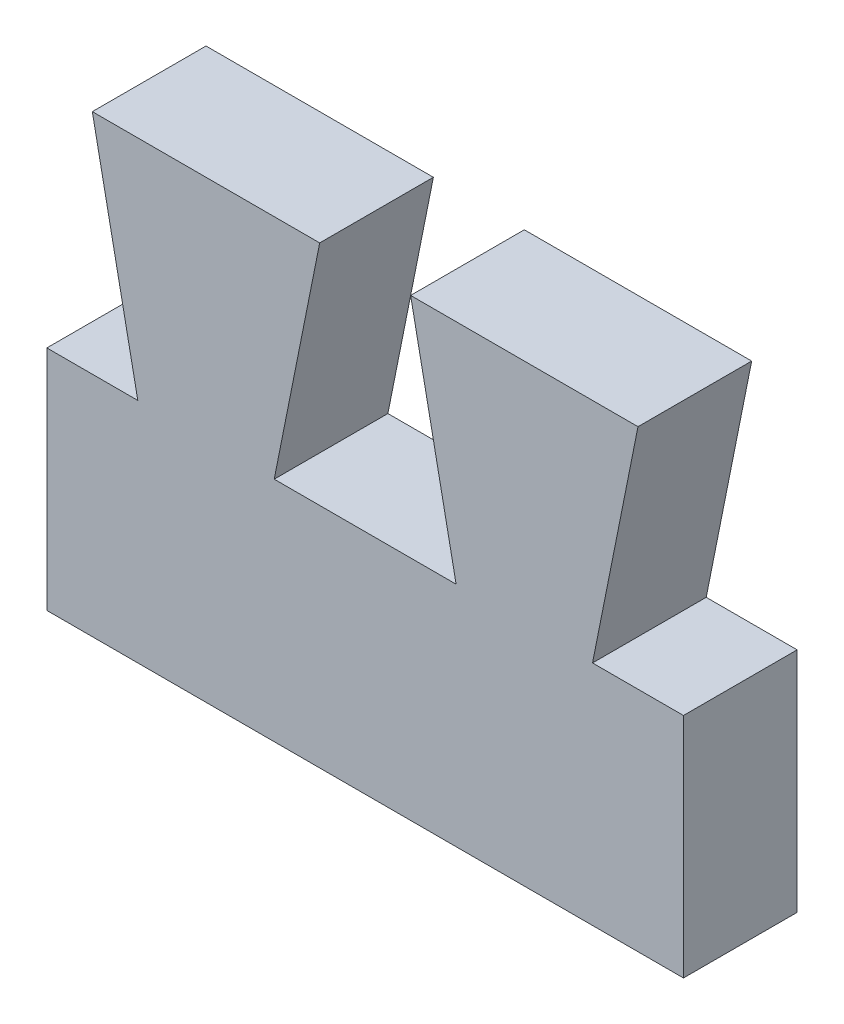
ISO-10303-21;
HEADER;
FILE_DESCRIPTION(('STEP AP214'),'2;1');
FILE_NAME('part.step','',(''),(''),'','','');
FILE_SCHEMA(('AUTOMOTIVE_DESIGN { 1 0 10303 214 1 1 1 1 }'));
ENDSEC;
DATA;
#1=APPLICATION_CONTEXT('core data for automotive mechanical design processes');
#2=APPLICATION_PROTOCOL_DEFINITION('international standard','automotive_design',2000,#1);
#3=PRODUCT_CONTEXT('',#1,'mechanical');
#4=PRODUCT('Part','Part','',(#3));
#5=PRODUCT_RELATED_PRODUCT_CATEGORY('part','',(#4));
#6=PRODUCT_DEFINITION_FORMATION('','',#4);
#7=PRODUCT_DEFINITION_CONTEXT('part definition',#1,'design');
#8=PRODUCT_DEFINITION('design','',#6,#7);
#9=PRODUCT_DEFINITION_SHAPE('','',#8);
#10=(LENGTH_UNIT() NAMED_UNIT(*) SI_UNIT(.MILLI.,.METRE.));
#11=(NAMED_UNIT(*) PLANE_ANGLE_UNIT() SI_UNIT($,.RADIAN.));
#12=(NAMED_UNIT(*) SI_UNIT($,.STERADIAN.) SOLID_ANGLE_UNIT());
#13=UNCERTAINTY_MEASURE_WITH_UNIT(LENGTH_MEASURE(1.E-05),#10,'distance_accuracy_value','');
#14=(GEOMETRIC_REPRESENTATION_CONTEXT(3) GLOBAL_UNCERTAINTY_ASSIGNED_CONTEXT((#13)) GLOBAL_UNIT_ASSIGNED_CONTEXT((#10,
#11,#12)) REPRESENTATION_CONTEXT('',''));
#15=CARTESIAN_POINT('',(0.,0.,0.));
#16=DIRECTION('',(0.,0.,1.));
#17=DIRECTION('',(1.,0.,0.));
#18=AXIS2_PLACEMENT_3D('',#15,#16,#17);
#19=CARTESIAN_POINT('',(14.,-5.,0.));
#20=DIRECTION('',(0.,1.,0.));
#21=DIRECTION('',(-1.,0.,0.));
#22=AXIS2_PLACEMENT_3D('',#19,#20,#21);
#23=PLANE('',#22);
#24=DIRECTION('',(0.,0.,-1.));
#25=VECTOR('',#24,1.);
#26=CARTESIAN_POINT('',(10.,-5.,5.));
#27=LINE('',#26,#25);
#28=CARTESIAN_POINT('',(10.,-5.,5.));
#29=VERTEX_POINT('',#28);
#30=CARTESIAN_POINT('',(10.,-5.,0.));
#31=VERTEX_POINT('',#30);
#32=EDGE_CURVE('E159',#29,#31,#27,.T.);
#33=ORIENTED_EDGE('',*,*,#32,.F.);
#34=DIRECTION('',(-1.,0.,0.));
#35=VECTOR('',#34,1.);
#36=CARTESIAN_POINT('',(14.,-5.,5.));
#37=LINE('',#36,#35);
#38=CARTESIAN_POINT('',(14.,-5.,5.));
#39=VERTEX_POINT('',#38);
#40=EDGE_CURVE('E151',#39,#29,#37,.T.);
#41=ORIENTED_EDGE('',*,*,#40,.F.);
#42=DIRECTION('',(0.,0.,1.));
#43=VECTOR('',#42,1.);
#44=CARTESIAN_POINT('',(14.,-5.,0.));
#45=LINE('',#44,#43);
#46=CARTESIAN_POINT('',(14.,-5.,0.));
#47=VERTEX_POINT('',#46);
#48=EDGE_CURVE('E192',#47,#39,#45,.T.);
#49=ORIENTED_EDGE('',*,*,#48,.F.);
#50=DIRECTION('',(-1.,0.,0.));
#51=VECTOR('',#50,1.);
#52=CARTESIAN_POINT('',(14.,-5.,0.));
#53=LINE('',#52,#51);
#54=EDGE_CURVE('E51',#47,#31,#53,.T.);
#55=ORIENTED_EDGE('',*,*,#54,.T.);
#56=EDGE_LOOP('',(#33,#41,#49,#55));
#57=FACE_BOUND('',#56,.T.);
#58=ADVANCED_FACE('F36',(#57),#23,.T.);
#59=CARTESIAN_POINT('',(-2.88461538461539,0.576923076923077,5.));
#60=DIRECTION('',(-0.98058067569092,0.196116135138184,0.));
#61=DIRECTION('',(-0.196116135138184,-0.98058067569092,0.));
#62=AXIS2_PLACEMENT_3D('',#59,#60,#61);
#63=PLANE('',#62);
#64=DIRECTION('',(0.196116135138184,0.98058067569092,0.));
#65=VECTOR('',#64,1.);
#66=CARTESIAN_POINT('',(-2.88461538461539,0.576923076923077,0.));
#67=LINE('',#66,#65);
#68=CARTESIAN_POINT('',(-4.,-5.,0.));
#69=VERTEX_POINT('',#68);
#70=CARTESIAN_POINT('',(-2.,5.,0.));
#71=VERTEX_POINT('',#70);
#72=EDGE_CURVE('E191',#69,#71,#67,.T.);
#73=ORIENTED_EDGE('',*,*,#72,.T.);
#74=DIRECTION('',(0.,0.,-1.));
#75=VECTOR('',#74,1.);
#76=CARTESIAN_POINT('',(-2.,5.,5.));
#77=LINE('',#76,#75);
#78=CARTESIAN_POINT('',(-2.,5.,5.));
#79=VERTEX_POINT('',#78);
#80=EDGE_CURVE('E44',#79,#71,#77,.T.);
#81=ORIENTED_EDGE('',*,*,#80,.F.);
#82=DIRECTION('',(0.196116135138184,0.98058067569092,0.));
#83=VECTOR('',#82,1.);
#84=CARTESIAN_POINT('',(-2.88461538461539,0.576923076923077,5.));
#85=LINE('',#84,#83);
#86=CARTESIAN_POINT('',(-4.,-5.,5.));
#87=VERTEX_POINT('',#86);
#88=EDGE_CURVE('E197',#87,#79,#85,.T.);
#89=ORIENTED_EDGE('',*,*,#88,.F.);
#90=DIRECTION('',(0.,0.,-1.));
#91=VECTOR('',#90,1.);
#92=CARTESIAN_POINT('',(-4.,-5.,5.));
#93=LINE('',#92,#91);
#94=EDGE_CURVE('E11',#87,#69,#93,.T.);
#95=ORIENTED_EDGE('',*,*,#94,.T.);
#96=EDGE_LOOP('',(#73,#81,#89,#95));
#97=FACE_BOUND('',#96,.T.);
#98=ADVANCED_FACE('F38',(#97),#63,.F.);
#99=CARTESIAN_POINT('',(0.,5.,5.));
#100=DIRECTION('',(0.,-1.,0.));
#101=DIRECTION('',(1.,0.,0.));
#102=AXIS2_PLACEMENT_3D('',#99,#100,#101);
#103=PLANE('',#102);
#104=DIRECTION('',(-1.,0.,0.));
#105=VECTOR('',#104,1.);
#106=CARTESIAN_POINT('',(0.,5.,0.));
#107=LINE('',#106,#105);
#108=CARTESIAN_POINT('',(-12.,5.,0.));
#109=VERTEX_POINT('',#108);
#110=EDGE_CURVE('E206',#71,#109,#107,.T.);
#111=ORIENTED_EDGE('',*,*,#110,.T.);
#112=DIRECTION('',(0.,0.,-1.));
#113=VECTOR('',#112,1.);
#114=CARTESIAN_POINT('',(-12.,5.,5.));
#115=LINE('',#114,#113);
#116=CARTESIAN_POINT('',(-12.,5.,5.));
#117=VERTEX_POINT('',#116);
#118=EDGE_CURVE('E211',#117,#109,#115,.T.);
#119=ORIENTED_EDGE('',*,*,#118,.F.);
#120=DIRECTION('',(-1.,0.,0.));
#121=VECTOR('',#120,1.);
#122=CARTESIAN_POINT('',(0.,5.,5.));
#123=LINE('',#122,#121);
#124=EDGE_CURVE('E199',#79,#117,#123,.T.);
#125=ORIENTED_EDGE('',*,*,#124,.F.);
#126=ORIENTED_EDGE('',*,*,#80,.T.);
#127=EDGE_LOOP('',(#111,#119,#125,#126));
#128=FACE_BOUND('',#127,.T.);
#129=ADVANCED_FACE('F218',(#128),#103,.F.);
#130=CARTESIAN_POINT('',(-10.5769230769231,-2.11538461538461,5.));
#131=DIRECTION('',(0.98058067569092,0.196116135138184,0.));
#132=DIRECTION('',(-0.196116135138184,0.98058067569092,0.));
#133=AXIS2_PLACEMENT_3D('',#130,#131,#132);
#134=PLANE('',#133);
#135=DIRECTION('',(0.196116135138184,-0.98058067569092,0.));
#136=VECTOR('',#135,1.);
#137=CARTESIAN_POINT('',(-10.5769230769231,-2.11538461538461,0.));
#138=LINE('',#137,#136);
#139=CARTESIAN_POINT('',(-10.,-5.,0.));
#140=VERTEX_POINT('',#139);
#141=EDGE_CURVE('E200',#109,#140,#138,.T.);
#142=ORIENTED_EDGE('',*,*,#141,.T.);
#143=DIRECTION('',(0.,0.,-1.));
#144=VECTOR('',#143,1.);
#145=CARTESIAN_POINT('',(-10.,-5.,5.));
#146=LINE('',#145,#144);
#147=CARTESIAN_POINT('',(-10.,-5.,5.));
#148=VERTEX_POINT('',#147);
#149=EDGE_CURVE('E204',#148,#140,#146,.T.);
#150=ORIENTED_EDGE('',*,*,#149,.F.);
#151=DIRECTION('',(0.196116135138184,-0.98058067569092,0.));
#152=VECTOR('',#151,1.);
#153=CARTESIAN_POINT('',(-10.5769230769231,-2.11538461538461,5.));
#154=LINE('',#153,#152);
#155=EDGE_CURVE('E202',#117,#148,#154,.T.);
#156=ORIENTED_EDGE('',*,*,#155,.F.);
#157=ORIENTED_EDGE('',*,*,#118,.T.);
#158=EDGE_LOOP('',(#142,#150,#156,#157));
#159=FACE_BOUND('',#158,.T.);
#160=ADVANCED_FACE('F230',(#159),#134,.F.);
#161=CARTESIAN_POINT('',(0.,0.,5.));
#162=DIRECTION('',(0.,0.,1.));
#163=DIRECTION('',(1.,0.,0.));
#164=AXIS2_PLACEMENT_3D('',#161,#162,#163);
#165=PLANE('',#164);
#166=ORIENTED_EDGE('',*,*,#155,.T.);
#167=CARTESIAN_POINT('',(-14.,-5.,5.));
#168=VERTEX_POINT('',#167);
#169=EDGE_CURVE('E186',#148,#168,#37,.T.);
#170=ORIENTED_EDGE('',*,*,#169,.T.);
#171=DIRECTION('',(0.,-1.,0.));
#172=VECTOR('',#171,1.);
#173=CARTESIAN_POINT('',(-14.,-15.,5.));
#174=LINE('',#173,#172);
#175=CARTESIAN_POINT('',(-14.,-15.,5.));
#176=VERTEX_POINT('',#175);
#177=EDGE_CURVE('E136',#168,#176,#174,.T.);
#178=ORIENTED_EDGE('',*,*,#177,.T.);
#179=DIRECTION('',(1.,0.,0.));
#180=VECTOR('',#179,1.);
#181=CARTESIAN_POINT('',(14.,-15.,5.));
#182=LINE('',#181,#180);
#183=CARTESIAN_POINT('',(14.,-15.,5.));
#184=VERTEX_POINT('',#183);
#185=EDGE_CURVE('E181',#176,#184,#182,.T.);
#186=ORIENTED_EDGE('',*,*,#185,.T.);
#187=DIRECTION('',(0.,1.,0.));
#188=VECTOR('',#187,1.);
#189=CARTESIAN_POINT('',(14.,-15.,5.));
#190=LINE('',#189,#188);
#191=EDGE_CURVE('E184',#184,#39,#190,.T.);
#192=ORIENTED_EDGE('',*,*,#191,.T.);
#193=ORIENTED_EDGE('',*,*,#40,.T.);
#194=DIRECTION('',(-0.196116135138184,-0.98058067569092,0.));
#195=VECTOR('',#194,1.);
#196=CARTESIAN_POINT('',(10.5769230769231,-2.11538461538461,5.));
#197=LINE('',#196,#195);
#198=CARTESIAN_POINT('',(12.,5.,5.));
#199=VERTEX_POINT('',#198);
#200=EDGE_CURVE('E130',#199,#29,#197,.T.);
#201=ORIENTED_EDGE('',*,*,#200,.F.);
#202=DIRECTION('',(-1.,0.,0.));
#203=VECTOR('',#202,1.);
#204=CARTESIAN_POINT('',(0.,5.,5.));
#205=LINE('',#204,#203);
#206=CARTESIAN_POINT('',(2.,5.,5.));
#207=VERTEX_POINT('',#206);
#208=EDGE_CURVE('E140',#199,#207,#205,.T.);
#209=ORIENTED_EDGE('',*,*,#208,.T.);
#210=DIRECTION('',(-0.196116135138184,0.98058067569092,0.));
#211=VECTOR('',#210,1.);
#212=CARTESIAN_POINT('',(2.88461538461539,0.576923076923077,5.));
#213=LINE('',#212,#211);
#214=CARTESIAN_POINT('',(4.,-5.,5.));
#215=VERTEX_POINT('',#214);
#216=EDGE_CURVE('E145',#215,#207,#213,.T.);
#217=ORIENTED_EDGE('',*,*,#216,.F.);
#218=EDGE_CURVE('E59',#215,#87,#37,.T.);
#219=ORIENTED_EDGE('',*,*,#218,.T.);
#220=ORIENTED_EDGE('',*,*,#88,.T.);
#221=ORIENTED_EDGE('',*,*,#124,.T.);
#222=EDGE_LOOP('',(#166,#170,#178,#186,#192,#193,#201,#209,#217,#219,#220,#221));
#223=FACE_BOUND('',#222,.T.);
#224=ADVANCED_FACE('F148',(#223),#165,.T.);
#225=CARTESIAN_POINT('',(0.,0.,0.));
#226=DIRECTION('',(0.,0.,1.));
#227=DIRECTION('',(1.,0.,0.));
#228=AXIS2_PLACEMENT_3D('',#225,#226,#227);
#229=PLANE('',#228);
#230=ORIENTED_EDGE('',*,*,#72,.F.);
#231=CARTESIAN_POINT('',(4.,-5.,0.));
#232=VERTEX_POINT('',#231);
#233=EDGE_CURVE('E178',#232,#69,#53,.T.);
#234=ORIENTED_EDGE('',*,*,#233,.F.);
#235=DIRECTION('',(-0.196116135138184,0.98058067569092,0.));
#236=VECTOR('',#235,1.);
#237=CARTESIAN_POINT('',(2.88461538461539,0.576923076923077,0.));
#238=LINE('',#237,#236);
#239=CARTESIAN_POINT('',(2.,5.,0.));
#240=VERTEX_POINT('',#239);
#241=EDGE_CURVE('E152',#232,#240,#238,.T.);
#242=ORIENTED_EDGE('',*,*,#241,.T.);
#243=DIRECTION('',(-1.,0.,0.));
#244=VECTOR('',#243,1.);
#245=CARTESIAN_POINT('',(0.,5.,0.));
#246=LINE('',#245,#244);
#247=CARTESIAN_POINT('',(12.,5.,0.));
#248=VERTEX_POINT('',#247);
#249=EDGE_CURVE('E155',#248,#240,#246,.T.);
#250=ORIENTED_EDGE('',*,*,#249,.F.);
#251=DIRECTION('',(-0.196116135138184,-0.98058067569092,0.));
#252=VECTOR('',#251,1.);
#253=CARTESIAN_POINT('',(10.5769230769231,-2.11538461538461,0.));
#254=LINE('',#253,#252);
#255=EDGE_CURVE('E132',#248,#31,#254,.T.);
#256=ORIENTED_EDGE('',*,*,#255,.T.);
#257=ORIENTED_EDGE('',*,*,#54,.F.);
#258=DIRECTION('',(0.,1.,0.));
#259=VECTOR('',#258,1.);
#260=CARTESIAN_POINT('',(14.,-15.,0.));
#261=LINE('',#260,#259);
#262=CARTESIAN_POINT('',(14.,-15.,0.));
#263=VERTEX_POINT('',#262);
#264=EDGE_CURVE('E172',#263,#47,#261,.T.);
#265=ORIENTED_EDGE('',*,*,#264,.F.);
#266=DIRECTION('',(1.,0.,0.));
#267=VECTOR('',#266,1.);
#268=CARTESIAN_POINT('',(14.,-15.,0.));
#269=LINE('',#268,#267);
#270=CARTESIAN_POINT('',(-14.,-15.,0.));
#271=VERTEX_POINT('',#270);
#272=EDGE_CURVE('E169',#271,#263,#269,.T.);
#273=ORIENTED_EDGE('',*,*,#272,.F.);
#274=DIRECTION('',(0.,-1.,0.));
#275=VECTOR('',#274,1.);
#276=CARTESIAN_POINT('',(-14.,-15.,0.));
#277=LINE('',#276,#275);
#278=CARTESIAN_POINT('',(-14.,-5.,0.));
#279=VERTEX_POINT('',#278);
#280=EDGE_CURVE('E166',#279,#271,#277,.T.);
#281=ORIENTED_EDGE('',*,*,#280,.F.);
#282=EDGE_CURVE('E175',#140,#279,#53,.T.);
#283=ORIENTED_EDGE('',*,*,#282,.F.);
#284=ORIENTED_EDGE('',*,*,#141,.F.);
#285=ORIENTED_EDGE('',*,*,#110,.F.);
#286=EDGE_LOOP('',(#230,#234,#242,#250,#256,#257,#265,#273,#281,#283,#284,#285));
#287=FACE_BOUND('',#286,.T.);
#288=ADVANCED_FACE('F225',(#287),#229,.F.);
#289=DIRECTION('',(0.,0.,-1.));
#290=VECTOR('',#289,1.);
#291=CARTESIAN_POINT('',(4.,-5.,5.));
#292=LINE('',#291,#290);
#293=EDGE_CURVE('E163',#215,#232,#292,.T.);
#294=ORIENTED_EDGE('',*,*,#293,.T.);
#295=ORIENTED_EDGE('',*,*,#233,.T.);
#296=ORIENTED_EDGE('',*,*,#94,.F.);
#297=ORIENTED_EDGE('',*,*,#218,.F.);
#298=EDGE_LOOP('',(#294,#295,#296,#297));
#299=FACE_BOUND('',#298,.T.);
#300=ADVANCED_FACE('F237',(#299),#23,.T.);
#301=CARTESIAN_POINT('',(-14.,-15.,0.));
#302=DIRECTION('',(-1.,0.,0.));
#303=DIRECTION('',(0.,0.,1.));
#304=AXIS2_PLACEMENT_3D('',#301,#302,#303);
#305=PLANE('',#304);
#306=ORIENTED_EDGE('',*,*,#177,.F.);
#307=DIRECTION('',(0.,0.,1.));
#308=VECTOR('',#307,1.);
#309=CARTESIAN_POINT('',(-14.,-5.,0.));
#310=LINE('',#309,#308);
#311=EDGE_CURVE('E188',#279,#168,#310,.T.);
#312=ORIENTED_EDGE('',*,*,#311,.F.);
#313=ORIENTED_EDGE('',*,*,#280,.T.);
#314=DIRECTION('',(0.,0.,1.));
#315=VECTOR('',#314,1.);
#316=CARTESIAN_POINT('',(-14.,-15.,0.));
#317=LINE('',#316,#315);
#318=EDGE_CURVE('E177',#271,#176,#317,.T.);
#319=ORIENTED_EDGE('',*,*,#318,.T.);
#320=EDGE_LOOP('',(#306,#312,#313,#319));
#321=FACE_BOUND('',#320,.T.);
#322=ADVANCED_FACE('F255',(#321),#305,.T.);
#323=ORIENTED_EDGE('',*,*,#169,.F.);
#324=ORIENTED_EDGE('',*,*,#149,.T.);
#325=ORIENTED_EDGE('',*,*,#282,.T.);
#326=ORIENTED_EDGE('',*,*,#311,.T.);
#327=EDGE_LOOP('',(#323,#324,#325,#326));
#328=FACE_BOUND('',#327,.T.);
#329=ADVANCED_FACE('F234',(#328),#23,.T.);
#330=CARTESIAN_POINT('',(14.,-15.,0.));
#331=DIRECTION('',(1.,0.,0.));
#332=DIRECTION('',(0.,0.,-1.));
#333=AXIS2_PLACEMENT_3D('',#330,#331,#332);
#334=PLANE('',#333);
#335=ORIENTED_EDGE('',*,*,#191,.F.);
#336=DIRECTION('',(0.,0.,1.));
#337=VECTOR('',#336,1.);
#338=CARTESIAN_POINT('',(14.,-15.,0.));
#339=LINE('',#338,#337);
#340=EDGE_CURVE('E194',#263,#184,#339,.T.);
#341=ORIENTED_EDGE('',*,*,#340,.F.);
#342=ORIENTED_EDGE('',*,*,#264,.T.);
#343=ORIENTED_EDGE('',*,*,#48,.T.);
#344=EDGE_LOOP('',(#335,#341,#342,#343));
#345=FACE_BOUND('',#344,.T.);
#346=ADVANCED_FACE('F257',(#345),#334,.T.);
#347=CARTESIAN_POINT('',(14.,-15.,0.));
#348=DIRECTION('',(0.,-1.,0.));
#349=DIRECTION('',(1.,0.,0.));
#350=AXIS2_PLACEMENT_3D('',#347,#348,#349);
#351=PLANE('',#350);
#352=ORIENTED_EDGE('',*,*,#185,.F.);
#353=ORIENTED_EDGE('',*,*,#318,.F.);
#354=ORIENTED_EDGE('',*,*,#272,.T.);
#355=ORIENTED_EDGE('',*,*,#340,.T.);
#356=EDGE_LOOP('',(#352,#353,#354,#355));
#357=FACE_BOUND('',#356,.T.);
#358=ADVANCED_FACE('F262',(#357),#351,.T.);
#359=CARTESIAN_POINT('',(10.5769230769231,-2.11538461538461,5.));
#360=DIRECTION('',(0.98058067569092,-0.196116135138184,0.));
#361=DIRECTION('',(0.196116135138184,0.98058067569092,0.));
#362=AXIS2_PLACEMENT_3D('',#359,#360,#361);
#363=PLANE('',#362);
#364=ORIENTED_EDGE('',*,*,#255,.F.);
#365=DIRECTION('',(0.,0.,-1.));
#366=VECTOR('',#365,1.);
#367=CARTESIAN_POINT('',(12.,5.,5.));
#368=LINE('',#367,#366);
#369=EDGE_CURVE('E126',#199,#248,#368,.T.);
#370=ORIENTED_EDGE('',*,*,#369,.F.);
#371=ORIENTED_EDGE('',*,*,#200,.T.);
#372=ORIENTED_EDGE('',*,*,#32,.T.);
#373=EDGE_LOOP('',(#364,#370,#371,#372));
#374=FACE_BOUND('',#373,.T.);
#375=ADVANCED_FACE('F128',(#374),#363,.T.);
#376=CARTESIAN_POINT('',(0.,5.,5.));
#377=DIRECTION('',(0.,-1.,0.));
#378=DIRECTION('',(1.,0.,0.));
#379=AXIS2_PLACEMENT_3D('',#376,#377,#378);
#380=PLANE('',#379);
#381=ORIENTED_EDGE('',*,*,#249,.T.);
#382=DIRECTION('',(0.,0.,-1.));
#383=VECTOR('',#382,1.);
#384=CARTESIAN_POINT('',(2.,5.,5.));
#385=LINE('',#384,#383);
#386=EDGE_CURVE('E137',#207,#240,#385,.T.);
#387=ORIENTED_EDGE('',*,*,#386,.F.);
#388=ORIENTED_EDGE('',*,*,#208,.F.);
#389=ORIENTED_EDGE('',*,*,#369,.T.);
#390=EDGE_LOOP('',(#381,#387,#388,#389));
#391=FACE_BOUND('',#390,.T.);
#392=ADVANCED_FACE('F141',(#391),#380,.F.);
#393=CARTESIAN_POINT('',(2.88461538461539,0.576923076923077,5.));
#394=DIRECTION('',(-0.98058067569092,-0.196116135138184,0.));
#395=DIRECTION('',(0.196116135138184,-0.98058067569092,0.));
#396=AXIS2_PLACEMENT_3D('',#393,#394,#395);
#397=PLANE('',#396);
#398=ORIENTED_EDGE('',*,*,#241,.F.);
#399=ORIENTED_EDGE('',*,*,#293,.F.);
#400=ORIENTED_EDGE('',*,*,#216,.T.);
#401=ORIENTED_EDGE('',*,*,#386,.T.);
#402=EDGE_LOOP('',(#398,#399,#400,#401));
#403=FACE_BOUND('',#402,.T.);
#404=ADVANCED_FACE('F240',(#403),#397,.T.);
#405=CLOSED_SHELL('',(#58,#98,#129,#160,#224,#288,#300,#322,#329,#346,#358,#375,#392,#404));
#406=MANIFOLD_SOLID_BREP('B2',#405);
#407=ADVANCED_BREP_SHAPE_REPRESENTATION('',(#18,#406),#14);
#408=SHAPE_DEFINITION_REPRESENTATION(#9,#407);
ENDSEC;
END-ISO-10303-21;
